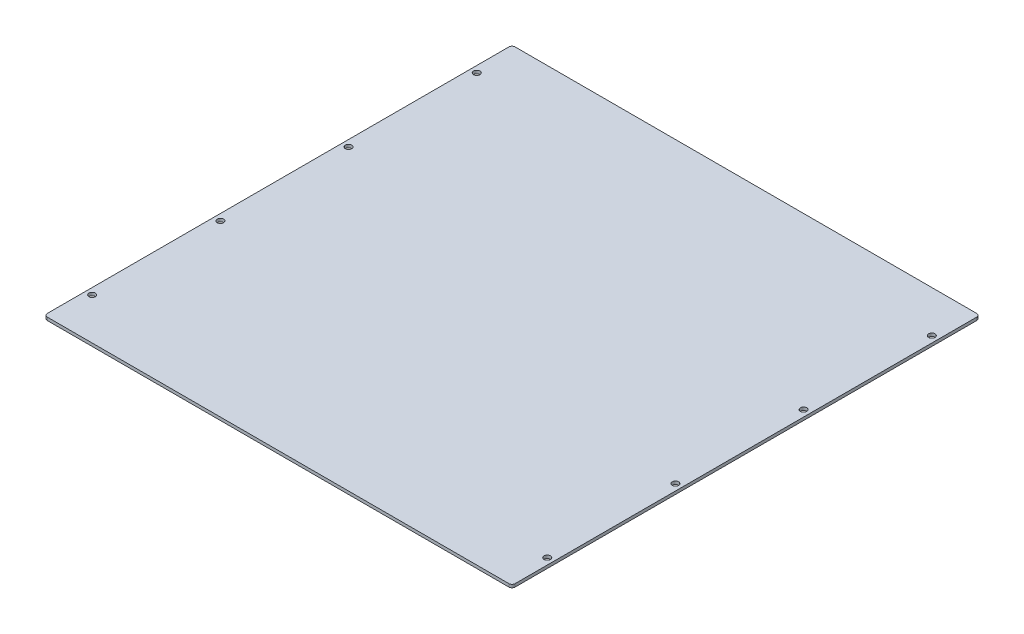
from build123d import *

# Parameters (mm, degrees)
SKETCH1_W                   = 463.55
SKETCH1_H                   = 463.55
BOSS_EXTRUDE1_DEPTH         = 2.9972
FILLET1_R                   = 3.175
F_1_4_0_25_DIAMETER_HOLE1_D = 6.35


with BuildPart() as part:
    # Sketch1 → Boss-Extrude1 (new body)
    with BuildSketch(Plane(origin=(0, 0, 0), x_dir=(1, 0, 0), z_dir=(0, 1, 0))):
        Rectangle(SKETCH1_W, SKETCH1_H)
    extrude(amount=BOSS_EXTRUDE1_DEPTH)

    # Fillet1
    fillet1_edges = [part.edges().sort_by_distance(p)[0] for p in [
        (231.775, 1.4986, 231.775),
        (-231.775, 1.4986, 231.775),
        (-231.775, 1.4986, -231.775),
        (231.775, 1.4986, -231.775),
    ]]
    fillet(fillet1_edges, radius=FILLET1_R)

    # 1_4 _0.25_ Diameter Hole1 (through all)
    with Locations(Plane(origin=(0, 2.9972, 0), x_dir=(1, 0, 0), z_dir=(0, 1, 0))):
        with Locations((-225.425, 190.5), (225.425, 190.5), (225.425, 63.5), (225.425, -63.5), (225.425, -190.5), (-225.425, 63.5), (-225.425, -63.5), (-225.425, -190.5)):
            Hole(F_1_4_0_25_DIAMETER_HOLE1_D / 2)


solid = part.part
